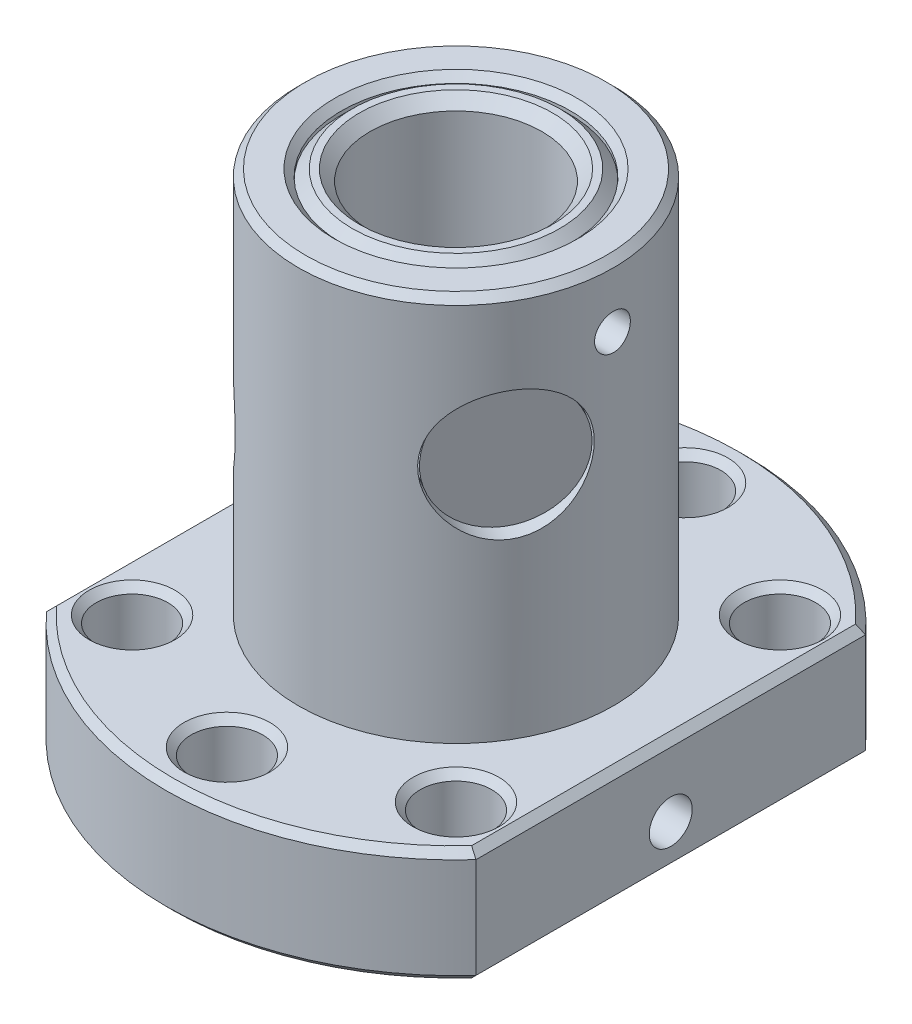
from build123d import *

# Parameters (mm, degrees)
BOSS_EXTRUDE1_DEPTH                 = 8
SKETCH2_R                           = 11
BOSS_EXTRUDE2_DEPTH                 = 27
F_16_0MM_DOWEL_HOLE1_D              = 16
F_5_0MM_DOWEL_HOLE1_D               = 5
F_3_0MM_DOWEL_HOLE1_D               = 3
M5_TAPPED_HOLE1_REACH               = 56.178
M5_TAPPED_HOLE1_BORE_R              = 2.1
F_8_0MM_DOWEL_HOLE1_REACH           = 42.666
F_8_0MM_DOWEL_HOLE1_BORE_R          = 4.5
F_8_0MM_DOWEL_HOLE1_ON_FACE_2_REACH = 45.289
F_8_0MM_DOWEL_HOLE1_BORE_2_R        = 4.5
F_8_0MM_DOWEL_HOLE1_ON_FACE_3_REACH = 42.423
F_8_0MM_DOWEL_HOLE1_BORE_3_R        = 4.5
M3_TAPPED_HOLE1_D                   = 2.5
SKETCH20_R                          = 8
SKETCH20_R_2                        = 6
BOSS_EXTRUDE3_DEPTH                 = 35
CHAMFER1_SIZE                       = 0.5
CHAMFER2_SIZE                       = 0.75
SKETCH21_R                          = 4.4
BOSS_EXTRUDE4_DEPTH                 = 2
SKETCH22_R                          = 4.4
BOSS_EXTRUDE5_DEPTH                 = 2
SKETCH23_R                          = 4.4
BOSS_EXTRUDE6_DEPTH                 = 2


with BuildPart() as part:
    # Sketch1 → Boss-Extrude1 (new body)
    with BuildSketch(Plane(origin=(0, 0, 0), x_dir=(1, 0, 0), z_dir=(0, 1, 0))):
        with BuildLine():
            Line((-15, 13.60376786), (-15, -13.60376786))
            ThreePointArc((-15, -13.60376786), (0, -20.25), (15, -13.60376786))
            Line((15, -13.60376786), (15, 13.60376786))
            ThreePointArc((15, 13.60376786), (0, 20.25), (-15, 13.60376786))
        make_face()
    extrude(amount=BOSS_EXTRUDE1_DEPTH)

    # Sketch2 → Boss-Extrude2 (add)
    with BuildSketch(Plane(origin=(0, 8, 0), x_dir=(1, 0, 0), z_dir=(0, 1, 0))):
        with Locations(Location((0, 0, 0), (0, 0, 270))):
            Circle(SKETCH2_R)
    extrude(amount=BOSS_EXTRUDE2_DEPTH)

    # 16.0mm Dowel Hole1 (through all)
    with Locations(Plane(origin=(0, 0, 0), x_dir=(-1, 0, 0), z_dir=(0, -1, 0))):
        with Locations((0, 0)):
            Hole(F_16_0MM_DOWEL_HOLE1_D / 2)

    # 5.0mm Dowel Hole1 (through all)
    with Locations(Plane(origin=(0, 0, 0), x_dir=(-1, 0, 0), z_dir=(0, -1, 0))):
        with Locations((0, -16), (11.313708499, -11.313708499), (-11.313708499, -11.313708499), (-11.313708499, 11.313708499), (0, 16), (11.313708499, 11.313708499)):
            Hole(F_5_0MM_DOWEL_HOLE1_D / 2)

    # 3.0mm Dowel Hole1 (through all)
    with Locations(Plane(origin=(15, 0, 0), x_dir=(0, 0, -1), z_dir=(1, 0, 0))):
        with Locations((0, 3)):
            Hole(F_3_0MM_DOWEL_HOLE1_D / 2)

    # M5 Tapped Hole1 bore (on position points) → M5 Tapped Hole1 (cut, up to next)
    with BuildSketch(Plane(origin=(7.749092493, 5, -18.708662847), x_dir=(-0.923884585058, 0, -0.382671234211), z_dir=(0.382671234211, 0, -0.923884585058)), mode=Mode.PRIVATE) as m5_tapped_hole1_sk1:
        Circle(M5_TAPPED_HOLE1_BORE_R)
    m5_tapped_hole1_tool1 = extrude(m5_tapped_hole1_sk1.sketch, amount=-M5_TAPPED_HOLE1_REACH, mode=Mode.PRIVATE) & part.part
    add(m5_tapped_hole1_tool1.solids().sort_by_distance((7.749092, 5, -18.708663))[0], mode=Mode.SUBTRACT)

    # 8.0mm Dowel Hole1 bore (on position points) → 8.0mm Dowel Hole1 (cut, up to next)
    with BuildSketch(Plane(origin=(-9.680222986, 19.890836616, 5.224297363), x_dir=(-0.474936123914, 0, -0.880020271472), z_dir=(-0.880020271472, 0, 0.474936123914)), mode=Mode.PRIVATE) as f_8_0mm_dowel_hole1_sk1:
        Circle(F_8_0MM_DOWEL_HOLE1_BORE_R)
    f_8_0mm_dowel_hole1_tool1 = extrude(f_8_0mm_dowel_hole1_sk1.sketch, amount=-F_8_0MM_DOWEL_HOLE1_REACH, mode=Mode.PRIVATE) & part.part
    add(f_8_0mm_dowel_hole1_tool1.solids().sort_by_distance((-9.680223, 19.890837, 5.224297))[0], mode=Mode.SUBTRACT)

    # 8.0mm Dowel Hole1 bore 2 (on position points) → 8.0mm Dowel Hole1 on face 2 (cut, up to next)
    with BuildSketch(Plane(origin=(9.450832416, 24.624777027, 5.628655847), x_dir=(-0.511695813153, 0, 0.859166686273), z_dir=(0.859166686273, 0, 0.511695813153)), mode=Mode.PRIVATE) as f_8_0mm_dowel_hole1_on_face_2_sk1:
        with Locations((-1e-09, 0)):
            Circle(F_8_0MM_DOWEL_HOLE1_BORE_2_R)
    f_8_0mm_dowel_hole1_on_face_2_tool1 = extrude(f_8_0mm_dowel_hole1_on_face_2_sk1.sketch, amount=-F_8_0MM_DOWEL_HOLE1_ON_FACE_2_REACH, mode=Mode.PRIVATE) & part.part
    add(f_8_0mm_dowel_hole1_on_face_2_tool1.solids().sort_by_distance((9.450832, 24.624777, 5.628656))[0], mode=Mode.SUBTRACT)

    # 8.0mm Dowel Hole1 bore 3 (on position points) → 8.0mm Dowel Hole1 on face 3 (cut, up to next)
    with BuildSketch(Plane(origin=(1.166452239, 15, -10.937979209), x_dir=(-0.994361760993, 0, -0.106040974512), z_dir=(0.106040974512, 0, -0.994361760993)), mode=Mode.PRIVATE) as f_8_0mm_dowel_hole1_on_face_3_sk1:
        Circle(F_8_0MM_DOWEL_HOLE1_BORE_3_R)
    f_8_0mm_dowel_hole1_on_face_3_tool1 = extrude(f_8_0mm_dowel_hole1_on_face_3_sk1.sketch, amount=-F_8_0MM_DOWEL_HOLE1_ON_FACE_3_REACH, mode=Mode.PRIVATE) & part.part
    add(f_8_0mm_dowel_hole1_on_face_3_tool1.solids().sort_by_distance((1.166452, 15, -10.937979))[0], mode=Mode.SUBTRACT)

    # M3 Tapped Hole1 (through all)
    with Locations(Plane(origin=(-15, 0, 0), x_dir=(0, 0, -1), z_dir=(-1, 0, 0))):
        with Locations((0, -30.622553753)):
            Hole(M3_TAPPED_HOLE1_D / 2)

    # Chamfer1
    chamfer1_edges = [part.edges().sort_by_distance(p)[0] for p in [
        (0, 8, 20.25),
        (15, 8, 0),
        (0, 35, -11),
        (-8, 0, 0),
        (-8, 35, 0),
        (-13.813708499, 0, -11.313708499),
        (-13.813708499, 8, -11.313708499),
        (-2.5, 0, -16),
        (-2.5, 8, -16),
        (0, 8, -20.25),
        (8.813708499, 0, -11.313708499),
        (8.813708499, 8, -11.313708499),
        (15, 0, 0),
        (8.813708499, 0, 11.313708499),
        (8.813708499, 8, 11.313708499),
        (0, 0, 20.25),
        (-15, 0, 0),
        (-13.813708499, 0, 11.313708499),
        (-13.813708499, 8, 11.313708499),
        (0, 0, -20.25),
        (-2.5, 0, 16),
        (-2.5, 8, 16),
        (-15, 8, 0),
    ]]
    chamfer(chamfer1_edges, length=CHAMFER1_SIZE)



with BuildPart() as body_2:
    # Sketch20 → Boss-Extrude3 (new body)
    with BuildSketch(Plane.XZ):
        with Locations(Location((0, 0, 0), (0, 0, 270))):
            Circle(SKETCH20_R)
        with Locations(Location((0, 0, 0), (0, 0, 270))):
            Circle(SKETCH20_R_2, mode=Mode.SUBTRACT)
    extrude(amount=-BOSS_EXTRUDE3_DEPTH)

    # Chamfer2
    chamfer2_edges = [body_2.edges().sort_by_distance(p)[0] for p in [
        (0, 0, 8),
        (0, 35, 6),
        (0, 35, 8),
        (0, 0, 6),
    ]]
    chamfer(chamfer2_edges, length=CHAMFER2_SIZE)


with BuildPart() as body_3:
    # Sketch21 → Boss-Extrude4 (new body)
    with BuildSketch(Plane(origin=(0.848328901, 0, -7.95489397), x_dir=(-0.9943617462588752, 0, -0.10604111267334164), z_dir=(0.10604111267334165, 0, -0.9943617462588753))):
        with Locations((0, 15)):
            Circle(SKETCH21_R)
    extrude(amount=BOSS_EXTRUDE4_DEPTH)


with BuildPart() as part_1:
    add(part.part)

    add(body_2.part)  # Boss-Extrude5 merges body 2
    # Sketch22 → Boss-Extrude5 (add)
    with BuildSketch(Plane(origin=(-7.040162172, 0, 3.799488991), x_dir=(0.4749361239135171, 0, 0.8800202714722), z_dir=(-0.8800202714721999, 0, 0.474936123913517))):
        with Locations(Location((0, 19.890836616, 0), (0, 0, 180))):
            Circle(SKETCH22_R)
    extrude(amount=BOSS_EXTRUDE5_DEPTH)


with BuildPart() as body_3_2:
    # Sketch23 → Boss-Extrude6 (new body)
    with BuildSketch(Plane(origin=(6.873332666, 0, 4.093567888), x_dir=(0.511695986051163, 0, -0.8591665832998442), z_dir=(0.8591665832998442, 0, 0.511695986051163))):
        with Locations((0, 24.624777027)):
            Circle(SKETCH23_R)
    extrude(amount=BOSS_EXTRUDE6_DEPTH)


solid = Compound([body_3.part, part_1.part, body_3_2.part])
